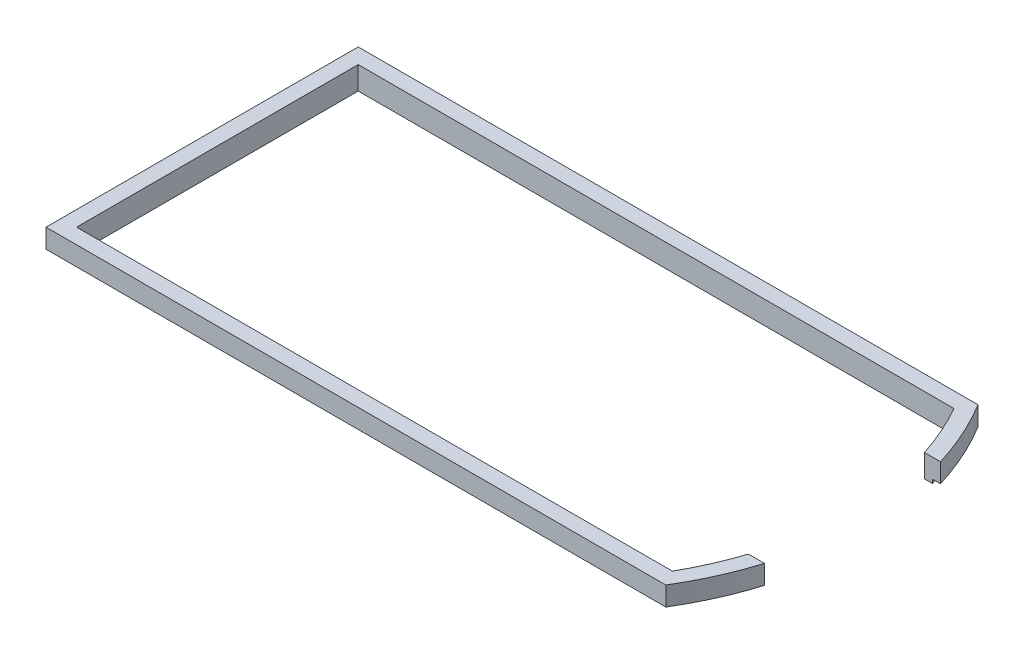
ISO-10303-21;
HEADER;
FILE_DESCRIPTION(('STEP AP214'),'2;1');
FILE_NAME('part.step','',(''),(''),'','','');
FILE_SCHEMA(('AUTOMOTIVE_DESIGN { 1 0 10303 214 1 1 1 1 }'));
ENDSEC;
DATA;
#1=APPLICATION_CONTEXT('core data for automotive mechanical design processes');
#2=APPLICATION_PROTOCOL_DEFINITION('international standard','automotive_design',2000,#1);
#3=PRODUCT_CONTEXT('',#1,'mechanical');
#4=PRODUCT('Part','Part','',(#3));
#5=PRODUCT_RELATED_PRODUCT_CATEGORY('part','',(#4));
#6=PRODUCT_DEFINITION_FORMATION('','',#4);
#7=PRODUCT_DEFINITION_CONTEXT('part definition',#1,'design');
#8=PRODUCT_DEFINITION('design','',#6,#7);
#9=PRODUCT_DEFINITION_SHAPE('','',#8);
#10=(LENGTH_UNIT() NAMED_UNIT(*) SI_UNIT(.MILLI.,.METRE.));
#11=(NAMED_UNIT(*) PLANE_ANGLE_UNIT() SI_UNIT($,.RADIAN.));
#12=(NAMED_UNIT(*) SI_UNIT($,.STERADIAN.) SOLID_ANGLE_UNIT());
#13=UNCERTAINTY_MEASURE_WITH_UNIT(LENGTH_MEASURE(1.E-05),#10,'distance_accuracy_value','');
#14=(GEOMETRIC_REPRESENTATION_CONTEXT(3) GLOBAL_UNCERTAINTY_ASSIGNED_CONTEXT((#13)) GLOBAL_UNIT_ASSIGNED_CONTEXT((#10,
#11,#12)) REPRESENTATION_CONTEXT('',''));
#15=CARTESIAN_POINT('',(0.,0.,0.));
#16=DIRECTION('',(0.,0.,1.));
#17=DIRECTION('',(1.,0.,0.));
#18=AXIS2_PLACEMENT_3D('',#15,#16,#17);
#19=CARTESIAN_POINT('',(47.51,-2.5,-20.4));
#20=DIRECTION('',(0.,1.,0.));
#21=DIRECTION('',(0.,0.,1.));
#22=AXIS2_PLACEMENT_3D('',#19,#20,#21);
#23=PLANE('',#22);
#24=CARTESIAN_POINT('',(47.5099999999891,-2.5,-20.3999999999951));
#25=DIRECTION('',(0.,-1.,0.));
#26=DIRECTION('',(0.,0.,1.));
#27=AXIS2_PLACEMENT_3D('',#24,#25,#26);
#28=CIRCLE('',#27,38.2100000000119);
#29=CARTESIAN_POINT('',(80.4287499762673,-2.5,-39.8));
#30=VERTEX_POINT('',#29);
#31=CARTESIAN_POINT('',(83.9483602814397,-2.5,-31.9));
#32=VERTEX_POINT('',#31);
#33=EDGE_CURVE('E48',#30,#32,#28,.T.);
#34=ORIENTED_EDGE('',*,*,#33,.F.);
#35=DIRECTION('',(1.,0.,0.));
#36=VECTOR('',#35,1.);
#37=CARTESIAN_POINT('',(1.,-2.5,-39.8));
#38=LINE('',#37,#36);
#39=CARTESIAN_POINT('',(1.,-2.5,-39.8));
#40=VERTEX_POINT('',#39);
#41=EDGE_CURVE('E52',#40,#30,#38,.T.);
#42=ORIENTED_EDGE('',*,*,#41,.F.);
#43=DIRECTION('',(0.,0.,-1.));
#44=VECTOR('',#43,1.);
#45=CARTESIAN_POINT('',(1.,-2.5,-0.999999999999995));
#46=LINE('',#45,#44);
#47=CARTESIAN_POINT('',(1.,-2.5,-0.999999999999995));
#48=VERTEX_POINT('',#47);
#49=EDGE_CURVE('E158',#48,#40,#46,.T.);
#50=ORIENTED_EDGE('',*,*,#49,.F.);
#51=DIRECTION('',(-1.,0.,0.));
#52=VECTOR('',#51,1.);
#53=CARTESIAN_POINT('',(80.4287499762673,-2.5,-0.999999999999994));
#54=LINE('',#53,#52);
#55=CARTESIAN_POINT('',(80.4287499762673,-2.5,-0.999999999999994));
#56=VERTEX_POINT('',#55);
#57=EDGE_CURVE('E153',#56,#48,#54,.T.);
#58=ORIENTED_EDGE('',*,*,#57,.F.);
#59=CARTESIAN_POINT('',(47.5099999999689,-2.5,-20.4000000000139));
#60=DIRECTION('',(0.,-1.,0.));
#61=DIRECTION('',(0.,0.,1.));
#62=AXIS2_PLACEMENT_3D('',#59,#60,#61);
#63=CIRCLE('',#62,38.2100000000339);
#64=CARTESIAN_POINT('',(83.9483602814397,-2.5,-8.9));
#65=VERTEX_POINT('',#64);
#66=EDGE_CURVE('E156',#65,#56,#63,.T.);
#67=ORIENTED_EDGE('',*,*,#66,.F.);
#68=DIRECTION('',(-1.,0.,0.));
#69=VECTOR('',#68,1.);
#70=CARTESIAN_POINT('',(84.9956519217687,-2.5,-8.9));
#71=LINE('',#70,#69);
#72=CARTESIAN_POINT('',(84.9956519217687,-2.5,-8.9));
#73=VERTEX_POINT('',#72);
#74=EDGE_CURVE('E222',#73,#65,#71,.T.);
#75=ORIENTED_EDGE('',*,*,#74,.F.);
#76=CARTESIAN_POINT('',(47.51,-2.5,-20.4));
#77=DIRECTION('',(0.,1.,0.));
#78=DIRECTION('',(0.,0.,1.));
#79=AXIS2_PLACEMENT_3D('',#76,#77,#78);
#80=CIRCLE('',#79,39.21);
#81=CARTESIAN_POINT('',(80.99528184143,-2.5,0.));
#82=VERTEX_POINT('',#81);
#83=EDGE_CURVE('E219',#82,#73,#80,.T.);
#84=ORIENTED_EDGE('',*,*,#83,.F.);
#85=DIRECTION('',(1.,0.,0.));
#86=VECTOR('',#85,1.);
#87=CARTESIAN_POINT('',(80.99528184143,-2.5,0.));
#88=LINE('',#87,#86);
#89=CARTESIAN_POINT('',(0.,-2.5,0.));
#90=VERTEX_POINT('',#89);
#91=EDGE_CURVE('E298',#90,#82,#88,.T.);
#92=ORIENTED_EDGE('',*,*,#91,.F.);
#93=DIRECTION('',(0.,0.,1.));
#94=VECTOR('',#93,1.);
#95=CARTESIAN_POINT('',(0.,-2.5,0.));
#96=LINE('',#95,#94);
#97=CARTESIAN_POINT('',(0.,-2.5,-40.8));
#98=VERTEX_POINT('',#97);
#99=EDGE_CURVE('E301',#98,#90,#96,.T.);
#100=ORIENTED_EDGE('',*,*,#99,.F.);
#101=DIRECTION('',(-1.,0.,0.));
#102=VECTOR('',#101,1.);
#103=CARTESIAN_POINT('',(80.99528184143,-2.5,-40.8));
#104=LINE('',#103,#102);
#105=CARTESIAN_POINT('',(80.99528184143,-2.5,-40.8));
#106=VERTEX_POINT('',#105);
#107=EDGE_CURVE('E304',#106,#98,#104,.T.);
#108=ORIENTED_EDGE('',*,*,#107,.F.);
#109=CARTESIAN_POINT('',(47.51,-2.5,-20.4));
#110=DIRECTION('',(0.,1.,0.));
#111=DIRECTION('',(0.,0.,-1.));
#112=AXIS2_PLACEMENT_3D('',#109,#110,#111);
#113=CIRCLE('',#112,39.21);
#114=CARTESIAN_POINT('',(84.9956519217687,-2.5,-31.9));
#115=VERTEX_POINT('',#114);
#116=EDGE_CURVE('E342',#115,#106,#113,.T.);
#117=ORIENTED_EDGE('',*,*,#116,.F.);
#118=DIRECTION('',(1.,0.,0.));
#119=VECTOR('',#118,1.);
#120=CARTESIAN_POINT('',(84.9956519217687,-2.5,-31.9));
#121=LINE('',#120,#119);
#122=EDGE_CURVE('E229',#32,#115,#121,.T.);
#123=ORIENTED_EDGE('',*,*,#122,.F.);
#124=EDGE_LOOP('',(#34,#42,#50,#58,#67,#75,#84,#92,#100,#108,#117,#123));
#125=FACE_BOUND('',#124,.T.);
#126=ADVANCED_FACE('F31',(#125),#23,.F.);
#127=CARTESIAN_POINT('',(47.51,-2.5,-20.4));
#128=DIRECTION('',(0.,1.,0.));
#129=DIRECTION('',(0.,0.,1.));
#130=AXIS2_PLACEMENT_3D('',#127,#128,#129);
#131=CYLINDRICAL_SURFACE('',#130,39.21);
#132=CARTESIAN_POINT('',(47.51,0.,-20.4));
#133=DIRECTION('',(0.,1.,0.));
#134=DIRECTION('',(0.,0.,1.));
#135=AXIS2_PLACEMENT_3D('',#132,#133,#134);
#136=CIRCLE('',#135,39.21);
#137=CARTESIAN_POINT('',(80.99528184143,0.,0.));
#138=VERTEX_POINT('',#137);
#139=CARTESIAN_POINT('',(84.9956519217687,0.,-8.9));
#140=VERTEX_POINT('',#139);
#141=EDGE_CURVE('E178',#138,#140,#136,.T.);
#142=ORIENTED_EDGE('',*,*,#141,.F.);
#143=DIRECTION('',(0.,1.,0.));
#144=VECTOR('',#143,1.);
#145=CARTESIAN_POINT('',(80.99528184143,-2.5,0.));
#146=LINE('',#145,#144);
#147=EDGE_CURVE('E11',#82,#138,#146,.T.);
#148=ORIENTED_EDGE('',*,*,#147,.F.);
#149=ORIENTED_EDGE('',*,*,#83,.T.);
#150=DIRECTION('',(0.,1.,0.));
#151=VECTOR('',#150,1.);
#152=CARTESIAN_POINT('',(84.9956519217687,-2.5,-8.9));
#153=LINE('',#152,#151);
#154=EDGE_CURVE('E289',#73,#140,#153,.T.);
#155=ORIENTED_EDGE('',*,*,#154,.T.);
#156=EDGE_LOOP('',(#142,#148,#149,#155));
#157=FACE_BOUND('',#156,.T.);
#158=ADVANCED_FACE('F33',(#157),#131,.T.);
#159=CARTESIAN_POINT('',(80.99528184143,-2.5,0.));
#160=DIRECTION('',(0.,0.,1.));
#161=DIRECTION('',(1.,0.,0.));
#162=AXIS2_PLACEMENT_3D('',#159,#160,#161);
#163=PLANE('',#162);
#164=DIRECTION('',(1.,0.,0.));
#165=VECTOR('',#164,1.);
#166=CARTESIAN_POINT('',(80.99528184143,0.,0.));
#167=LINE('',#166,#165);
#168=CARTESIAN_POINT('',(0.,0.,0.));
#169=VERTEX_POINT('',#168);
#170=EDGE_CURVE('E216',#169,#138,#167,.T.);
#171=ORIENTED_EDGE('',*,*,#170,.F.);
#172=DIRECTION('',(0.,1.,0.));
#173=VECTOR('',#172,1.);
#174=CARTESIAN_POINT('',(0.,-2.5,0.));
#175=LINE('',#174,#173);
#176=EDGE_CURVE('E40',#90,#169,#175,.T.);
#177=ORIENTED_EDGE('',*,*,#176,.F.);
#178=ORIENTED_EDGE('',*,*,#91,.T.);
#179=ORIENTED_EDGE('',*,*,#147,.T.);
#180=EDGE_LOOP('',(#171,#177,#178,#179));
#181=FACE_BOUND('',#180,.T.);
#182=ADVANCED_FACE('F297',(#181),#163,.T.);
#183=CARTESIAN_POINT('',(0.,-2.5,0.));
#184=DIRECTION('',(-1.,0.,0.));
#185=DIRECTION('',(0.,0.,1.));
#186=AXIS2_PLACEMENT_3D('',#183,#184,#185);
#187=PLANE('',#186);
#188=DIRECTION('',(0.,0.,1.));
#189=VECTOR('',#188,1.);
#190=CARTESIAN_POINT('',(0.,0.,0.));
#191=LINE('',#190,#189);
#192=CARTESIAN_POINT('',(0.,0.,-40.8));
#193=VERTEX_POINT('',#192);
#194=EDGE_CURVE('E213',#193,#169,#191,.T.);
#195=ORIENTED_EDGE('',*,*,#194,.F.);
#196=DIRECTION('',(0.,1.,0.));
#197=VECTOR('',#196,1.);
#198=CARTESIAN_POINT('',(0.,-2.5,-40.8));
#199=LINE('',#198,#197);
#200=EDGE_CURVE('E309',#98,#193,#199,.T.);
#201=ORIENTED_EDGE('',*,*,#200,.F.);
#202=ORIENTED_EDGE('',*,*,#99,.T.);
#203=ORIENTED_EDGE('',*,*,#176,.T.);
#204=EDGE_LOOP('',(#195,#201,#202,#203));
#205=FACE_BOUND('',#204,.T.);
#206=ADVANCED_FACE('F335',(#205),#187,.T.);
#207=CARTESIAN_POINT('',(80.99528184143,-2.5,-40.8));
#208=DIRECTION('',(0.,0.,-1.));
#209=DIRECTION('',(-1.,0.,0.));
#210=AXIS2_PLACEMENT_3D('',#207,#208,#209);
#211=PLANE('',#210);
#212=DIRECTION('',(-1.,0.,0.));
#213=VECTOR('',#212,1.);
#214=CARTESIAN_POINT('',(80.99528184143,0.,-40.8));
#215=LINE('',#214,#213);
#216=CARTESIAN_POINT('',(80.99528184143,0.,-40.8));
#217=VERTEX_POINT('',#216);
#218=EDGE_CURVE('E210',#217,#193,#215,.T.);
#219=ORIENTED_EDGE('',*,*,#218,.F.);
#220=DIRECTION('',(0.,1.,0.));
#221=VECTOR('',#220,1.);
#222=CARTESIAN_POINT('',(80.99528184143,-2.5,-40.8));
#223=LINE('',#222,#221);
#224=EDGE_CURVE('E311',#106,#217,#223,.T.);
#225=ORIENTED_EDGE('',*,*,#224,.F.);
#226=ORIENTED_EDGE('',*,*,#107,.T.);
#227=ORIENTED_EDGE('',*,*,#200,.T.);
#228=EDGE_LOOP('',(#219,#225,#226,#227));
#229=FACE_BOUND('',#228,.T.);
#230=ADVANCED_FACE('F341',(#229),#211,.T.);
#231=CARTESIAN_POINT('',(47.51,-2.5,-20.4));
#232=DIRECTION('',(0.,1.,0.));
#233=DIRECTION('',(0.,0.,1.));
#234=AXIS2_PLACEMENT_3D('',#231,#232,#233);
#235=CYLINDRICAL_SURFACE('',#234,39.21);
#236=CARTESIAN_POINT('',(47.51,0.,-20.4));
#237=DIRECTION('',(0.,1.,0.));
#238=DIRECTION('',(0.,0.,-1.));
#239=AXIS2_PLACEMENT_3D('',#236,#237,#238);
#240=CIRCLE('',#239,39.21);
#241=CARTESIAN_POINT('',(84.9956519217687,0.,-31.9));
#242=VERTEX_POINT('',#241);
#243=EDGE_CURVE('E207',#242,#217,#240,.T.);
#244=ORIENTED_EDGE('',*,*,#243,.F.);
#245=DIRECTION('',(0.,1.,0.));
#246=VECTOR('',#245,1.);
#247=CARTESIAN_POINT('',(84.9956519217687,-2.5,-31.9));
#248=LINE('',#247,#246);
#249=EDGE_CURVE('E313',#115,#242,#248,.T.);
#250=ORIENTED_EDGE('',*,*,#249,.F.);
#251=ORIENTED_EDGE('',*,*,#116,.T.);
#252=ORIENTED_EDGE('',*,*,#224,.T.);
#253=EDGE_LOOP('',(#244,#250,#251,#252));
#254=FACE_BOUND('',#253,.T.);
#255=ADVANCED_FACE('F352',(#254),#235,.T.);
#256=CARTESIAN_POINT('',(84.9956519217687,-2.5,-31.9));
#257=DIRECTION('',(0.,0.,1.));
#258=DIRECTION('',(1.,0.,0.));
#259=AXIS2_PLACEMENT_3D('',#256,#257,#258);
#260=PLANE('',#259);
#261=DIRECTION('',(1.,0.,0.));
#262=VECTOR('',#261,1.);
#263=CARTESIAN_POINT('',(84.9956519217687,0.,-31.9));
#264=LINE('',#263,#262);
#265=CARTESIAN_POINT('',(82.8983328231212,0.,-31.9));
#266=VERTEX_POINT('',#265);
#267=EDGE_CURVE('E204',#266,#242,#264,.T.);
#268=ORIENTED_EDGE('',*,*,#267,.F.);
#269=DIRECTION('',(0.,1.,0.));
#270=VECTOR('',#269,1.);
#271=CARTESIAN_POINT('',(82.8983328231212,-2.5,-31.9));
#272=LINE('',#271,#270);
#273=CARTESIAN_POINT('',(82.8983328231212,-3.,-31.9));
#274=VERTEX_POINT('',#273);
#275=EDGE_CURVE('E315',#274,#266,#272,.T.);
#276=ORIENTED_EDGE('',*,*,#275,.F.);
#277=DIRECTION('',(-1.,0.,0.));
#278=VECTOR('',#277,1.);
#279=CARTESIAN_POINT('',(82.8983328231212,-3.,-31.9));
#280=LINE('',#279,#278);
#281=CARTESIAN_POINT('',(83.9483602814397,-3.,-31.9));
#282=VERTEX_POINT('',#281);
#283=EDGE_CURVE('E256',#282,#274,#280,.T.);
#284=ORIENTED_EDGE('',*,*,#283,.F.);
#285=DIRECTION('',(0.,1.,0.));
#286=VECTOR('',#285,1.);
#287=CARTESIAN_POINT('',(83.9483602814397,-3.,-31.9));
#288=LINE('',#287,#286);
#289=EDGE_CURVE('E238',#282,#32,#288,.T.);
#290=ORIENTED_EDGE('',*,*,#289,.T.);
#291=ORIENTED_EDGE('',*,*,#122,.T.);
#292=ORIENTED_EDGE('',*,*,#249,.T.);
#293=EDGE_LOOP('',(#268,#276,#284,#290,#291,#292));
#294=FACE_BOUND('',#293,.T.);
#295=ADVANCED_FACE('F348',(#294),#260,.T.);
#296=CARTESIAN_POINT('',(47.51,-2.5,-20.4));
#297=DIRECTION('',(0.,1.,0.));
#298=DIRECTION('',(0.,0.,1.));
#299=AXIS2_PLACEMENT_3D('',#296,#297,#298);
#300=CYLINDRICAL_SURFACE('',#299,37.21);
#301=CARTESIAN_POINT('',(47.51,0.,-20.4));
#302=DIRECTION('',(0.,-1.,0.));
#303=DIRECTION('',(0.,0.,-1.));
#304=AXIS2_PLACEMENT_3D('',#301,#302,#303);
#305=CIRCLE('',#304,37.21);
#306=CARTESIAN_POINT('',(79.8522958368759,0.,-38.8));
#307=VERTEX_POINT('',#306);
#308=EDGE_CURVE('E201',#307,#266,#305,.T.);
#309=ORIENTED_EDGE('',*,*,#308,.F.);
#310=DIRECTION('',(0.,1.,0.));
#311=VECTOR('',#310,1.);
#312=CARTESIAN_POINT('',(79.8522958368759,-2.5,-38.8));
#313=LINE('',#312,#311);
#314=CARTESIAN_POINT('',(79.8522958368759,-3.,-38.8));
#315=VERTEX_POINT('',#314);
#316=EDGE_CURVE('E317',#315,#307,#313,.T.);
#317=ORIENTED_EDGE('',*,*,#316,.F.);
#318=CARTESIAN_POINT('',(47.5099999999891,-3.,-20.3999999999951));
#319=DIRECTION('',(0.,1.,0.));
#320=DIRECTION('',(0.,0.,1.));
#321=AXIS2_PLACEMENT_3D('',#318,#319,#320);
#322=CIRCLE('',#321,37.2100000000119);
#323=EDGE_CURVE('E259',#274,#315,#322,.T.);
#324=ORIENTED_EDGE('',*,*,#323,.F.);
#325=ORIENTED_EDGE('',*,*,#275,.T.);
#326=EDGE_LOOP('',(#309,#317,#324,#325));
#327=FACE_BOUND('',#326,.T.);
#328=ADVANCED_FACE('F358',(#327),#300,.F.);
#329=CARTESIAN_POINT('',(79.8522958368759,-2.5,-38.8));
#330=DIRECTION('',(0.,0.,1.));
#331=DIRECTION('',(1.,0.,0.));
#332=AXIS2_PLACEMENT_3D('',#329,#330,#331);
#333=PLANE('',#332);
#334=DIRECTION('',(1.,0.,0.));
#335=VECTOR('',#334,1.);
#336=CARTESIAN_POINT('',(79.8522958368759,0.,-38.8));
#337=LINE('',#336,#335);
#338=CARTESIAN_POINT('',(2.,0.,-38.8));
#339=VERTEX_POINT('',#338);
#340=EDGE_CURVE('E198',#339,#307,#337,.T.);
#341=ORIENTED_EDGE('',*,*,#340,.F.);
#342=DIRECTION('',(0.,1.,0.));
#343=VECTOR('',#342,1.);
#344=CARTESIAN_POINT('',(2.,-2.5,-38.8));
#345=LINE('',#344,#343);
#346=CARTESIAN_POINT('',(2.,-3.,-38.8));
#347=VERTEX_POINT('',#346);
#348=EDGE_CURVE('E319',#347,#339,#345,.T.);
#349=ORIENTED_EDGE('',*,*,#348,.F.);
#350=DIRECTION('',(-1.,0.,0.));
#351=VECTOR('',#350,1.);
#352=CARTESIAN_POINT('',(2.,-3.,-38.8));
#353=LINE('',#352,#351);
#354=EDGE_CURVE('E262',#315,#347,#353,.T.);
#355=ORIENTED_EDGE('',*,*,#354,.F.);
#356=ORIENTED_EDGE('',*,*,#316,.T.);
#357=EDGE_LOOP('',(#341,#349,#355,#356));
#358=FACE_BOUND('',#357,.T.);
#359=ADVANCED_FACE('F361',(#358),#333,.T.);
#360=CARTESIAN_POINT('',(2.,-2.5,-38.8));
#361=DIRECTION('',(1.,0.,0.));
#362=DIRECTION('',(0.,0.,-1.));
#363=AXIS2_PLACEMENT_3D('',#360,#361,#362);
#364=PLANE('',#363);
#365=DIRECTION('',(0.,0.,-1.));
#366=VECTOR('',#365,1.);
#367=CARTESIAN_POINT('',(2.,0.,-38.8));
#368=LINE('',#367,#366);
#369=CARTESIAN_POINT('',(2.,0.,-2.));
#370=VERTEX_POINT('',#369);
#371=EDGE_CURVE('E195',#370,#339,#368,.T.);
#372=ORIENTED_EDGE('',*,*,#371,.F.);
#373=DIRECTION('',(0.,1.,0.));
#374=VECTOR('',#373,1.);
#375=CARTESIAN_POINT('',(2.,-2.5,-2.));
#376=LINE('',#375,#374);
#377=CARTESIAN_POINT('',(2.,-3.,-2.));
#378=VERTEX_POINT('',#377);
#379=EDGE_CURVE('E321',#378,#370,#376,.T.);
#380=ORIENTED_EDGE('',*,*,#379,.F.);
#381=DIRECTION('',(0.,0.,1.));
#382=VECTOR('',#381,1.);
#383=CARTESIAN_POINT('',(2.,-3.,-2.));
#384=LINE('',#383,#382);
#385=EDGE_CURVE('E265',#347,#378,#384,.T.);
#386=ORIENTED_EDGE('',*,*,#385,.F.);
#387=ORIENTED_EDGE('',*,*,#348,.T.);
#388=EDGE_LOOP('',(#372,#380,#386,#387));
#389=FACE_BOUND('',#388,.T.);
#390=ADVANCED_FACE('F365',(#389),#364,.T.);
#391=CARTESIAN_POINT('',(79.8522958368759,-2.5,-1.99999999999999));
#392=DIRECTION('',(0.,0.,-1.));
#393=DIRECTION('',(-1.,0.,0.));
#394=AXIS2_PLACEMENT_3D('',#391,#392,#393);
#395=PLANE('',#394);
#396=DIRECTION('',(-1.,0.,0.));
#397=VECTOR('',#396,1.);
#398=CARTESIAN_POINT('',(79.8522958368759,0.,-1.99999999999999));
#399=LINE('',#398,#397);
#400=CARTESIAN_POINT('',(79.8522958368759,0.,-1.99999999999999));
#401=VERTEX_POINT('',#400);
#402=EDGE_CURVE('E192',#401,#370,#399,.T.);
#403=ORIENTED_EDGE('',*,*,#402,.F.);
#404=DIRECTION('',(0.,1.,0.));
#405=VECTOR('',#404,1.);
#406=CARTESIAN_POINT('',(79.8522958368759,-2.5,-1.99999999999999));
#407=LINE('',#406,#405);
#408=CARTESIAN_POINT('',(79.8522958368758,-3.,-1.99999999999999));
#409=VERTEX_POINT('',#408);
#410=EDGE_CURVE('E324',#409,#401,#407,.T.);
#411=ORIENTED_EDGE('',*,*,#410,.F.);
#412=DIRECTION('',(1.,0.,0.));
#413=VECTOR('',#412,1.);
#414=CARTESIAN_POINT('',(79.8522958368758,-3.,-1.99999999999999));
#415=LINE('',#414,#413);
#416=EDGE_CURVE('E268',#378,#409,#415,.T.);
#417=ORIENTED_EDGE('',*,*,#416,.F.);
#418=ORIENTED_EDGE('',*,*,#379,.T.);
#419=EDGE_LOOP('',(#403,#411,#417,#418));
#420=FACE_BOUND('',#419,.T.);
#421=ADVANCED_FACE('F367',(#420),#395,.T.);
#422=CARTESIAN_POINT('',(47.51,-2.5,-20.4));
#423=DIRECTION('',(0.,1.,0.));
#424=DIRECTION('',(0.,0.,1.));
#425=AXIS2_PLACEMENT_3D('',#422,#423,#424);
#426=CYLINDRICAL_SURFACE('',#425,37.21);
#427=CARTESIAN_POINT('',(47.51,0.,-20.4));
#428=DIRECTION('',(0.,-1.,0.));
#429=DIRECTION('',(0.,0.,1.));
#430=AXIS2_PLACEMENT_3D('',#427,#428,#429);
#431=CIRCLE('',#430,37.21);
#432=CARTESIAN_POINT('',(82.8983328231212,0.,-8.9));
#433=VERTEX_POINT('',#432);
#434=EDGE_CURVE('E189',#433,#401,#431,.T.);
#435=ORIENTED_EDGE('',*,*,#434,.F.);
#436=DIRECTION('',(0.,1.,0.));
#437=VECTOR('',#436,1.);
#438=CARTESIAN_POINT('',(82.8983328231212,-2.5,-8.9));
#439=LINE('',#438,#437);
#440=CARTESIAN_POINT('',(82.8983328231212,-3.,-8.9));
#441=VERTEX_POINT('',#440);
#442=EDGE_CURVE('E303',#441,#433,#439,.T.);
#443=ORIENTED_EDGE('',*,*,#442,.F.);
#444=CARTESIAN_POINT('',(47.5099999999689,-3.,-20.4000000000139));
#445=DIRECTION('',(0.,1.,0.));
#446=DIRECTION('',(0.,0.,1.));
#447=AXIS2_PLACEMENT_3D('',#444,#445,#446);
#448=CIRCLE('',#447,37.2100000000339);
#449=EDGE_CURVE('E237',#409,#441,#448,.T.);
#450=ORIENTED_EDGE('',*,*,#449,.F.);
#451=ORIENTED_EDGE('',*,*,#410,.T.);
#452=EDGE_LOOP('',(#435,#443,#450,#451));
#453=FACE_BOUND('',#452,.T.);
#454=ADVANCED_FACE('F328',(#453),#426,.F.);
#455=CARTESIAN_POINT('',(84.9956519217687,-2.5,-8.9));
#456=DIRECTION('',(0.,0.,-1.));
#457=DIRECTION('',(-1.,0.,0.));
#458=AXIS2_PLACEMENT_3D('',#455,#456,#457);
#459=PLANE('',#458);
#460=DIRECTION('',(-1.,0.,0.));
#461=VECTOR('',#460,1.);
#462=CARTESIAN_POINT('',(84.9956519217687,0.,-8.9));
#463=LINE('',#462,#461);
#464=EDGE_CURVE('E186',#140,#433,#463,.T.);
#465=ORIENTED_EDGE('',*,*,#464,.F.);
#466=ORIENTED_EDGE('',*,*,#154,.F.);
#467=ORIENTED_EDGE('',*,*,#74,.T.);
#468=DIRECTION('',(0.,1.,0.));
#469=VECTOR('',#468,1.);
#470=CARTESIAN_POINT('',(83.9483602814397,-3.,-8.9));
#471=LINE('',#470,#469);
#472=CARTESIAN_POINT('',(83.9483602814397,-3.,-8.9));
#473=VERTEX_POINT('',#472);
#474=EDGE_CURVE('E172',#473,#65,#471,.T.);
#475=ORIENTED_EDGE('',*,*,#474,.F.);
#476=DIRECTION('',(1.,0.,0.));
#477=VECTOR('',#476,1.);
#478=CARTESIAN_POINT('',(82.8983328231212,-3.,-8.9));
#479=LINE('',#478,#477);
#480=EDGE_CURVE('E245',#441,#473,#479,.T.);
#481=ORIENTED_EDGE('',*,*,#480,.F.);
#482=ORIENTED_EDGE('',*,*,#442,.T.);
#483=EDGE_LOOP('',(#465,#466,#467,#475,#481,#482));
#484=FACE_BOUND('',#483,.T.);
#485=ADVANCED_FACE('F288',(#484),#459,.T.);
#486=CARTESIAN_POINT('',(47.51,0.,-20.4));
#487=DIRECTION('',(0.,1.,0.));
#488=DIRECTION('',(0.,0.,1.));
#489=AXIS2_PLACEMENT_3D('',#486,#487,#488);
#490=PLANE('',#489);
#491=ORIENTED_EDGE('',*,*,#141,.T.);
#492=ORIENTED_EDGE('',*,*,#464,.T.);
#493=ORIENTED_EDGE('',*,*,#434,.T.);
#494=ORIENTED_EDGE('',*,*,#402,.T.);
#495=ORIENTED_EDGE('',*,*,#371,.T.);
#496=ORIENTED_EDGE('',*,*,#340,.T.);
#497=ORIENTED_EDGE('',*,*,#308,.T.);
#498=ORIENTED_EDGE('',*,*,#267,.T.);
#499=ORIENTED_EDGE('',*,*,#243,.T.);
#500=ORIENTED_EDGE('',*,*,#218,.T.);
#501=ORIENTED_EDGE('',*,*,#194,.T.);
#502=ORIENTED_EDGE('',*,*,#170,.T.);
#503=EDGE_LOOP('',(#491,#492,#493,#494,#495,#496,#497,#498,#499,#500,#501,#502));
#504=FACE_BOUND('',#503,.T.);
#505=ADVANCED_FACE('F331',(#504),#490,.T.);
#506=CARTESIAN_POINT('',(47.5099999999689,-3.,-20.4000000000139));
#507=DIRECTION('',(0.,1.,0.));
#508=DIRECTION('',(0.,0.,1.));
#509=AXIS2_PLACEMENT_3D('',#506,#507,#508);
#510=CYLINDRICAL_SURFACE('',#509,38.2100000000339);
#511=ORIENTED_EDGE('',*,*,#66,.T.);
#512=DIRECTION('',(0.,1.,0.));
#513=VECTOR('',#512,1.);
#514=CARTESIAN_POINT('',(80.4287499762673,-3.,-0.999999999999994));
#515=LINE('',#514,#513);
#516=CARTESIAN_POINT('',(80.4287499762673,-3.,-0.999999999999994));
#517=VERTEX_POINT('',#516);
#518=EDGE_CURVE('E169',#517,#56,#515,.T.);
#519=ORIENTED_EDGE('',*,*,#518,.F.);
#520=CARTESIAN_POINT('',(47.5099999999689,-3.,-20.4000000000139));
#521=DIRECTION('',(0.,-1.,0.));
#522=DIRECTION('',(0.,0.,1.));
#523=AXIS2_PLACEMENT_3D('',#520,#521,#522);
#524=CIRCLE('',#523,38.2100000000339);
#525=EDGE_CURVE('E247',#473,#517,#524,.T.);
#526=ORIENTED_EDGE('',*,*,#525,.F.);
#527=ORIENTED_EDGE('',*,*,#474,.T.);
#528=EDGE_LOOP('',(#511,#519,#526,#527));
#529=FACE_BOUND('',#528,.T.);
#530=ADVANCED_FACE('F167',(#529),#510,.T.);
#531=CARTESIAN_POINT('',(80.4287499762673,-3.,-0.999999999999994));
#532=DIRECTION('',(0.,0.,-1.));
#533=DIRECTION('',(-1.,0.,0.));
#534=AXIS2_PLACEMENT_3D('',#531,#532,#533);
#535=PLANE('',#534);
#536=ORIENTED_EDGE('',*,*,#57,.T.);
#537=DIRECTION('',(0.,1.,0.));
#538=VECTOR('',#537,1.);
#539=CARTESIAN_POINT('',(1.,-3.,-0.999999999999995));
#540=LINE('',#539,#538);
#541=CARTESIAN_POINT('',(1.,-3.,-0.999999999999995));
#542=VERTEX_POINT('',#541);
#543=EDGE_CURVE('E176',#542,#48,#540,.T.);
#544=ORIENTED_EDGE('',*,*,#543,.F.);
#545=DIRECTION('',(-1.,0.,0.));
#546=VECTOR('',#545,1.);
#547=CARTESIAN_POINT('',(80.4287499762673,-3.,-0.999999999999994));
#548=LINE('',#547,#546);
#549=EDGE_CURVE('E175',#517,#542,#548,.T.);
#550=ORIENTED_EDGE('',*,*,#549,.F.);
#551=ORIENTED_EDGE('',*,*,#518,.T.);
#552=EDGE_LOOP('',(#536,#544,#550,#551));
#553=FACE_BOUND('',#552,.T.);
#554=ADVANCED_FACE('F174',(#553),#535,.F.);
#555=CARTESIAN_POINT('',(1.,-3.,-0.999999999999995));
#556=DIRECTION('',(1.,0.,0.));
#557=DIRECTION('',(0.,0.,-1.));
#558=AXIS2_PLACEMENT_3D('',#555,#556,#557);
#559=PLANE('',#558);
#560=ORIENTED_EDGE('',*,*,#49,.T.);
#561=DIRECTION('',(0.,1.,0.));
#562=VECTOR('',#561,1.);
#563=CARTESIAN_POINT('',(1.,-3.,-39.8));
#564=LINE('',#563,#562);
#565=CARTESIAN_POINT('',(1.,-3.,-39.8));
#566=VERTEX_POINT('',#565);
#567=EDGE_CURVE('E180',#566,#40,#564,.T.);
#568=ORIENTED_EDGE('',*,*,#567,.F.);
#569=DIRECTION('',(0.,0.,-1.));
#570=VECTOR('',#569,1.);
#571=CARTESIAN_POINT('',(1.,-3.,-0.999999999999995));
#572=LINE('',#571,#570);
#573=EDGE_CURVE('E250',#542,#566,#572,.T.);
#574=ORIENTED_EDGE('',*,*,#573,.F.);
#575=ORIENTED_EDGE('',*,*,#543,.T.);
#576=EDGE_LOOP('',(#560,#568,#574,#575));
#577=FACE_BOUND('',#576,.T.);
#578=ADVANCED_FACE('F281',(#577),#559,.F.);
#579=CARTESIAN_POINT('',(1.,-3.,-39.8));
#580=DIRECTION('',(0.,0.,1.));
#581=DIRECTION('',(1.,0.,0.));
#582=AXIS2_PLACEMENT_3D('',#579,#580,#581);
#583=PLANE('',#582);
#584=ORIENTED_EDGE('',*,*,#41,.T.);
#585=DIRECTION('',(0.,1.,0.));
#586=VECTOR('',#585,1.);
#587=CARTESIAN_POINT('',(80.4287499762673,-3.,-39.8));
#588=LINE('',#587,#586);
#589=CARTESIAN_POINT('',(80.4287499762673,-3.,-39.8));
#590=VERTEX_POINT('',#589);
#591=EDGE_CURVE('E271',#590,#30,#588,.T.);
#592=ORIENTED_EDGE('',*,*,#591,.F.);
#593=DIRECTION('',(1.,0.,0.));
#594=VECTOR('',#593,1.);
#595=CARTESIAN_POINT('',(1.,-3.,-39.8));
#596=LINE('',#595,#594);
#597=EDGE_CURVE('E252',#566,#590,#596,.T.);
#598=ORIENTED_EDGE('',*,*,#597,.F.);
#599=ORIENTED_EDGE('',*,*,#567,.T.);
#600=EDGE_LOOP('',(#584,#592,#598,#599));
#601=FACE_BOUND('',#600,.T.);
#602=ADVANCED_FACE('F277',(#601),#583,.F.);
#603=CARTESIAN_POINT('',(47.5099999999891,-3.,-20.3999999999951));
#604=DIRECTION('',(0.,1.,0.));
#605=DIRECTION('',(0.,0.,1.));
#606=AXIS2_PLACEMENT_3D('',#603,#604,#605);
#607=CYLINDRICAL_SURFACE('',#606,38.2100000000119);
#608=ORIENTED_EDGE('',*,*,#33,.T.);
#609=ORIENTED_EDGE('',*,*,#289,.F.);
#610=CARTESIAN_POINT('',(47.5099999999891,-3.,-20.3999999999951));
#611=DIRECTION('',(0.,-1.,0.));
#612=DIRECTION('',(0.,0.,1.));
#613=AXIS2_PLACEMENT_3D('',#610,#611,#612);
#614=CIRCLE('',#613,38.2100000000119);
#615=EDGE_CURVE('E254',#590,#282,#614,.T.);
#616=ORIENTED_EDGE('',*,*,#615,.F.);
#617=ORIENTED_EDGE('',*,*,#591,.T.);
#618=EDGE_LOOP('',(#608,#609,#616,#617));
#619=FACE_BOUND('',#618,.T.);
#620=ADVANCED_FACE('F459',(#619),#607,.T.);
#621=CARTESIAN_POINT('',(47.5099999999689,-3.,-20.4000000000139));
#622=DIRECTION('',(0.,1.,0.));
#623=DIRECTION('',(0.,0.,1.));
#624=AXIS2_PLACEMENT_3D('',#621,#622,#623);
#625=PLANE('',#624);
#626=ORIENTED_EDGE('',*,*,#449,.T.);
#627=ORIENTED_EDGE('',*,*,#480,.T.);
#628=ORIENTED_EDGE('',*,*,#525,.T.);
#629=ORIENTED_EDGE('',*,*,#549,.T.);
#630=ORIENTED_EDGE('',*,*,#573,.T.);
#631=ORIENTED_EDGE('',*,*,#597,.T.);
#632=ORIENTED_EDGE('',*,*,#615,.T.);
#633=ORIENTED_EDGE('',*,*,#283,.T.);
#634=ORIENTED_EDGE('',*,*,#323,.T.);
#635=ORIENTED_EDGE('',*,*,#354,.T.);
#636=ORIENTED_EDGE('',*,*,#385,.T.);
#637=ORIENTED_EDGE('',*,*,#416,.T.);
#638=EDGE_LOOP('',(#626,#627,#628,#629,#630,#631,#632,#633,#634,#635,#636,#637));
#639=FACE_BOUND('',#638,.T.);
#640=ADVANCED_FACE('F283',(#639),#625,.F.);
#641=CLOSED_SHELL('',(#126,#158,#182,#206,#230,#255,#295,#328,#359,#390,#421,#454,#485,#505,
#530,#554,#578,#602,#620,#640));
#642=MANIFOLD_SOLID_BREP('B2',#641);
#643=ADVANCED_BREP_SHAPE_REPRESENTATION('',(#18,#642),#14);
#644=SHAPE_DEFINITION_REPRESENTATION(#9,#643);
ENDSEC;
END-ISO-10303-21;
